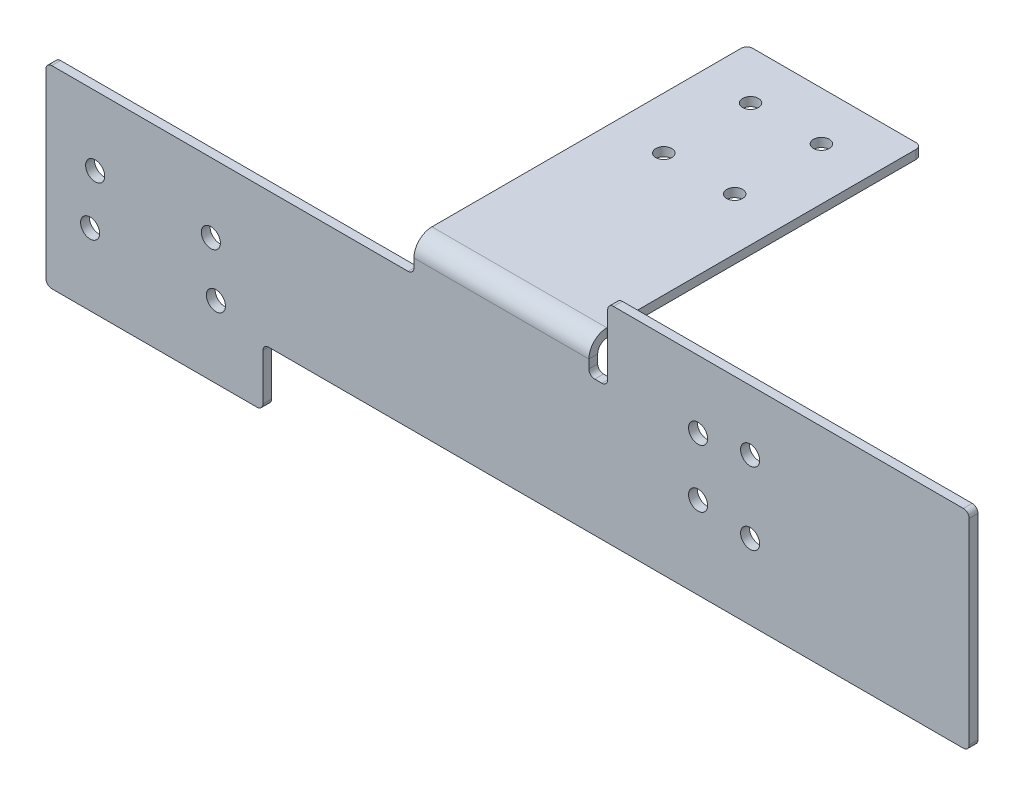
ISO-10303-21;
HEADER;
FILE_DESCRIPTION(('STEP AP214'),'2;1');
FILE_NAME('part.step','',(''),(''),'','','');
FILE_SCHEMA(('AUTOMOTIVE_DESIGN { 1 0 10303 214 1 1 1 1 }'));
ENDSEC;
DATA;
#1=APPLICATION_CONTEXT('core data for automotive mechanical design processes');
#2=APPLICATION_PROTOCOL_DEFINITION('international standard','automotive_design',2000,#1);
#3=PRODUCT_CONTEXT('',#1,'mechanical');
#4=PRODUCT('Part','Part','',(#3));
#5=PRODUCT_RELATED_PRODUCT_CATEGORY('part','',(#4));
#6=PRODUCT_DEFINITION_FORMATION('','',#4);
#7=PRODUCT_DEFINITION_CONTEXT('part definition',#1,'design');
#8=PRODUCT_DEFINITION('design','',#6,#7);
#9=PRODUCT_DEFINITION_SHAPE('','',#8);
#10=(LENGTH_UNIT() NAMED_UNIT(*) SI_UNIT(.MILLI.,.METRE.));
#11=(NAMED_UNIT(*) PLANE_ANGLE_UNIT() SI_UNIT($,.RADIAN.));
#12=(NAMED_UNIT(*) SI_UNIT($,.STERADIAN.) SOLID_ANGLE_UNIT());
#13=UNCERTAINTY_MEASURE_WITH_UNIT(LENGTH_MEASURE(1.E-05),#10,'distance_accuracy_value','');
#14=(GEOMETRIC_REPRESENTATION_CONTEXT(3) GLOBAL_UNCERTAINTY_ASSIGNED_CONTEXT((#13)) GLOBAL_UNIT_ASSIGNED_CONTEXT((#10,
#11,#12)) REPRESENTATION_CONTEXT('',''));
#15=CARTESIAN_POINT('',(0.,0.,0.));
#16=DIRECTION('',(0.,0.,1.));
#17=DIRECTION('',(1.,0.,0.));
#18=AXIS2_PLACEMENT_3D('',#15,#16,#17);
#19=CARTESIAN_POINT('',(182.,-8.17499999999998,6.22299999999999));
#20=DIRECTION('',(0.,-1.,0.));
#21=DIRECTION('',(0.,0.,-1.));
#22=AXIS2_PLACEMENT_3D('',#19,#20,#21);
#23=PLANE('',#22);
#24=DIRECTION('',(-1.,0.,0.));
#25=VECTOR('',#24,1.);
#26=CARTESIAN_POINT('',(182.,-8.17499999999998,6.22299999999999));
#27=LINE('',#26,#25);
#28=CARTESIAN_POINT('',(110.,-8.17499999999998,6.22299999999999));
#29=VERTEX_POINT('',#28);
#30=CARTESIAN_POINT('',(107.5,-8.17499999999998,6.22299999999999));
#31=VERTEX_POINT('',#30);
#32=EDGE_CURVE('E280',#29,#31,#27,.T.);
#33=ORIENTED_EDGE('',*,*,#32,.F.);
#34=DIRECTION('',(0.,0.,1.));
#35=VECTOR('',#34,1.);
#36=CARTESIAN_POINT('',(110.,-8.17499999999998,3.175));
#37=LINE('',#36,#35);
#38=CARTESIAN_POINT('',(110.,-8.17499999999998,3.175));
#39=VERTEX_POINT('',#38);
#40=EDGE_CURVE('E254',#29,#39,#37,.F.);
#41=ORIENTED_EDGE('',*,*,#40,.T.);
#42=DIRECTION('',(-1.,0.,0.));
#43=VECTOR('',#42,1.);
#44=CARTESIAN_POINT('',(182.,-8.17499999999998,3.175));
#45=LINE('',#44,#43);
#46=CARTESIAN_POINT('',(107.5,-8.17499999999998,3.175));
#47=VERTEX_POINT('',#46);
#48=EDGE_CURVE('E282',#39,#47,#45,.T.);
#49=ORIENTED_EDGE('',*,*,#48,.T.);
#50=DIRECTION('',(0.,0.,1.));
#51=VECTOR('',#50,1.);
#52=CARTESIAN_POINT('',(107.5,-8.17499999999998,6.22299999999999));
#53=LINE('',#52,#51);
#54=EDGE_CURVE('E398',#47,#31,#53,.T.);
#55=ORIENTED_EDGE('',*,*,#54,.T.);
#56=EDGE_LOOP('',(#33,#41,#49,#55));
#57=FACE_BOUND('',#56,.T.);
#58=ADVANCED_FACE('F59',(#57),#23,.F.);
#59=CARTESIAN_POINT('',(0.,0.,6.22299999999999));
#60=DIRECTION('',(0.,0.,1.));
#61=DIRECTION('',(0.,-1.,0.));
#62=AXIS2_PLACEMENT_3D('',#59,#60,#61);
#63=PLANE('',#62);
#64=CARTESIAN_POINT('',(143.25,-6.53499999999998,6.22299999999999));
#65=DIRECTION('',(0.,0.,1.));
#66=DIRECTION('',(1.,0.,0.));
#67=AXIS2_PLACEMENT_3D('',#64,#65,#66);
#68=CIRCLE('',#67,3.3);
#69=CARTESIAN_POINT('',(146.55,-6.53499999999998,6.22299999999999));
#70=VERTEX_POINT('',#69);
#71=EDGE_CURVE('E1088',#70,#70,#68,.T.);
#72=ORIENTED_EDGE('',*,*,#71,.F.);
#73=EDGE_LOOP('',(#72));
#74=FACE_BOUND('',#73,.T.);
#75=CARTESIAN_POINT('',(143.25,-26.535,6.22299999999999));
#76=DIRECTION('',(0.,0.,1.));
#77=DIRECTION('',(1.,0.,0.));
#78=AXIS2_PLACEMENT_3D('',#75,#76,#77);
#79=CIRCLE('',#78,3.3);
#80=CARTESIAN_POINT('',(146.55,-26.535,6.22299999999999));
#81=VERTEX_POINT('',#80);
#82=EDGE_CURVE('E1094',#81,#81,#79,.T.);
#83=ORIENTED_EDGE('',*,*,#82,.F.);
#84=EDGE_LOOP('',(#83));
#85=FACE_BOUND('',#84,.T.);
#86=CARTESIAN_POINT('',(161.25,-29.035,6.22299999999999));
#87=DIRECTION('',(0.,0.,1.));
#88=DIRECTION('',(1.,0.,0.));
#89=AXIS2_PLACEMENT_3D('',#86,#87,#88);
#90=CIRCLE('',#89,3.3);
#91=CARTESIAN_POINT('',(164.55,-29.035,6.22299999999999));
#92=VERTEX_POINT('',#91);
#93=EDGE_CURVE('E1100',#92,#92,#90,.T.);
#94=ORIENTED_EDGE('',*,*,#93,.F.);
#95=EDGE_LOOP('',(#94));
#96=FACE_BOUND('',#95,.T.);
#97=CARTESIAN_POINT('',(161.25,-4.03499999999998,6.22299999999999));
#98=DIRECTION('',(0.,0.,1.));
#99=DIRECTION('',(1.,0.,0.));
#100=AXIS2_PLACEMENT_3D('',#97,#98,#99);
#101=CIRCLE('',#100,3.3);
#102=CARTESIAN_POINT('',(164.55,-4.03499999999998,6.22299999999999));
#103=VERTEX_POINT('',#102);
#104=EDGE_CURVE('E1106',#103,#103,#101,.T.);
#105=ORIENTED_EDGE('',*,*,#104,.F.);
#106=EDGE_LOOP('',(#105));
#107=FACE_BOUND('',#106,.T.);
#108=CARTESIAN_POINT('',(-65.22,-32.175,6.22299999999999));
#109=DIRECTION('',(0.,0.,1.));
#110=DIRECTION('',(0.,-1.,0.));
#111=AXIS2_PLACEMENT_3D('',#108,#109,#110);
#112=CIRCLE('',#111,3.29999999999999);
#113=CARTESIAN_POINT('',(-65.22,-35.475,6.223));
#114=VERTEX_POINT('',#113);
#115=EDGE_CURVE('E303',#114,#114,#112,.T.);
#116=ORIENTED_EDGE('',*,*,#115,.F.);
#117=EDGE_LOOP('',(#116));
#118=FACE_BOUND('',#117,.T.);
#119=CARTESIAN_POINT('',(-66.97,-50.175,6.22299999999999));
#120=DIRECTION('',(0.,0.,1.));
#121=DIRECTION('',(0.,-1.,0.));
#122=AXIS2_PLACEMENT_3D('',#119,#120,#121);
#123=CIRCLE('',#122,3.29999999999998);
#124=CARTESIAN_POINT('',(-66.97,-53.475,6.223));
#125=VERTEX_POINT('',#124);
#126=EDGE_CURVE('E297',#125,#125,#123,.T.);
#127=ORIENTED_EDGE('',*,*,#126,.F.);
#128=EDGE_LOOP('',(#127));
#129=FACE_BOUND('',#128,.T.);
#130=CARTESIAN_POINT('',(-23.47,-50.175,6.22299999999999));
#131=DIRECTION('',(0.,0.,1.));
#132=DIRECTION('',(0.,-1.,0.));
#133=AXIS2_PLACEMENT_3D('',#130,#131,#132);
#134=CIRCLE('',#133,3.29999999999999);
#135=CARTESIAN_POINT('',(-23.47,-53.475,6.223));
#136=VERTEX_POINT('',#135);
#137=EDGE_CURVE('E291',#136,#136,#134,.T.);
#138=ORIENTED_EDGE('',*,*,#137,.F.);
#139=EDGE_LOOP('',(#138));
#140=FACE_BOUND('',#139,.T.);
#141=CARTESIAN_POINT('',(-25.22,-32.175,6.22299999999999));
#142=DIRECTION('',(0.,0.,1.));
#143=DIRECTION('',(0.,-1.,0.));
#144=AXIS2_PLACEMENT_3D('',#141,#142,#143);
#145=CIRCLE('',#144,3.29999999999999);
#146=CARTESIAN_POINT('',(-25.22,-35.475,6.223));
#147=VERTEX_POINT('',#146);
#148=EDGE_CURVE('E285',#147,#147,#145,.T.);
#149=ORIENTED_EDGE('',*,*,#148,.F.);
#150=EDGE_LOOP('',(#149));
#151=FACE_BOUND('',#150,.T.);
#152=DIRECTION('',(0.,-1.,0.));
#153=VECTOR('',#152,1.);
#154=CARTESIAN_POINT('',(237.,-75.,6.22299999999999));
#155=LINE('',#154,#153);
#156=CARTESIAN_POINT('',(237.,14.825,6.22299999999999));
#157=VERTEX_POINT('',#156);
#158=CARTESIAN_POINT('',(237.,-53.,6.22299999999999));
#159=VERTEX_POINT('',#158);
#160=EDGE_CURVE('E63',#157,#159,#155,.T.);
#161=ORIENTED_EDGE('',*,*,#160,.F.);
#162=CARTESIAN_POINT('',(235.,14.825,6.22299999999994));
#163=DIRECTION('',(0.,0.,1.));
#164=DIRECTION('',(0.,-1.,0.));
#165=AXIS2_PLACEMENT_3D('',#162,#163,#164);
#166=CIRCLE('',#165,2.);
#167=CARTESIAN_POINT('',(235.,16.825,6.22299999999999));
#168=VERTEX_POINT('',#167);
#169=EDGE_CURVE('E243',#157,#168,#166,.T.);
#170=ORIENTED_EDGE('',*,*,#169,.T.);
#171=DIRECTION('',(1.,0.,0.));
#172=VECTOR('',#171,1.);
#173=CARTESIAN_POINT('',(182.,16.825,6.22299999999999));
#174=LINE('',#173,#172);
#175=CARTESIAN_POINT('',(114.,16.825,6.22299999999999));
#176=VERTEX_POINT('',#175);
#177=EDGE_CURVE('E250',#176,#168,#174,.T.);
#178=ORIENTED_EDGE('',*,*,#177,.F.);
#179=CARTESIAN_POINT('',(114.,14.825,6.22299999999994));
#180=DIRECTION('',(0.,0.,1.));
#181=DIRECTION('',(0.,-1.,0.));
#182=AXIS2_PLACEMENT_3D('',#179,#180,#181);
#183=CIRCLE('',#182,2.);
#184=CARTESIAN_POINT('',(112.,14.825,6.22299999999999));
#185=VERTEX_POINT('',#184);
#186=EDGE_CURVE('E234',#176,#185,#183,.T.);
#187=ORIENTED_EDGE('',*,*,#186,.T.);
#188=DIRECTION('',(0.,-1.,0.));
#189=VECTOR('',#188,1.);
#190=CARTESIAN_POINT('',(112.,16.825,6.22299999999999));
#191=LINE('',#190,#189);
#192=CARTESIAN_POINT('',(112.,-6.17499999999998,6.22299999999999));
#193=VERTEX_POINT('',#192);
#194=EDGE_CURVE('E258',#185,#193,#191,.T.);
#195=ORIENTED_EDGE('',*,*,#194,.T.);
#196=CARTESIAN_POINT('',(110.,-6.17499999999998,6.22300000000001));
#197=DIRECTION('',(0.,0.,1.));
#198=DIRECTION('',(0.,-1.,0.));
#199=AXIS2_PLACEMENT_3D('',#196,#197,#198);
#200=CIRCLE('',#199,2.);
#201=EDGE_CURVE('E68',#193,#29,#200,.F.);
#202=ORIENTED_EDGE('',*,*,#201,.T.);
#203=ORIENTED_EDGE('',*,*,#32,.T.);
#204=CARTESIAN_POINT('',(107.5,-6.17499999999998,6.22300000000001));
#205=DIRECTION('',(0.,0.,1.));
#206=DIRECTION('',(0.,-1.,0.));
#207=AXIS2_PLACEMENT_3D('',#204,#205,#206);
#208=CIRCLE('',#207,2.);
#209=CARTESIAN_POINT('',(105.5,-6.17499999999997,6.22300000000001));
#210=VERTEX_POINT('',#209);
#211=EDGE_CURVE('E416',#31,#210,#208,.F.);
#212=ORIENTED_EDGE('',*,*,#211,.T.);
#213=DIRECTION('',(0.,-1.,0.));
#214=VECTOR('',#213,1.);
#215=CARTESIAN_POINT('',(105.5,-75.,6.22300000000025));
#216=LINE('',#215,#214);
#217=CARTESIAN_POINT('',(105.5,-3.17499999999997,6.223));
#218=VERTEX_POINT('',#217);
#219=EDGE_CURVE('E337',#218,#210,#216,.T.);
#220=ORIENTED_EDGE('',*,*,#219,.F.);
#221=DIRECTION('',(-1.,0.,0.));
#222=VECTOR('',#221,1.);
#223=CARTESIAN_POINT('',(0.,-3.17499999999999,6.223));
#224=LINE('',#223,#222);
#225=CARTESIAN_POINT('',(45.,-3.17499999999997,6.223));
#226=VERTEX_POINT('',#225);
#227=EDGE_CURVE('E343',#218,#226,#224,.T.);
#228=ORIENTED_EDGE('',*,*,#227,.T.);
#229=DIRECTION('',(0.,1.,0.));
#230=VECTOR('',#229,1.);
#231=CARTESIAN_POINT('',(45.,0.,6.22299999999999));
#232=LINE('',#231,#230);
#233=CARTESIAN_POINT('',(45.,-6.17499999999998,6.22300000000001));
#234=VERTEX_POINT('',#233);
#235=EDGE_CURVE('E336',#234,#226,#232,.T.);
#236=ORIENTED_EDGE('',*,*,#235,.F.);
#237=CARTESIAN_POINT('',(43.,-6.17499999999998,6.22300000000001));
#238=DIRECTION('',(0.,0.,1.));
#239=DIRECTION('',(0.,-1.,0.));
#240=AXIS2_PLACEMENT_3D('',#237,#238,#239);
#241=CIRCLE('',#240,2.);
#242=CARTESIAN_POINT('',(43.,-8.17499999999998,6.223));
#243=VERTEX_POINT('',#242);
#244=EDGE_CURVE('E471',#234,#243,#241,.F.);
#245=ORIENTED_EDGE('',*,*,#244,.T.);
#246=DIRECTION('',(1.,0.,0.));
#247=VECTOR('',#246,1.);
#248=CARTESIAN_POINT('',(-82.22,-8.17499999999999,6.223));
#249=LINE('',#248,#247);
#250=CARTESIAN_POINT('',(-80.22,-8.17499999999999,6.223));
#251=VERTEX_POINT('',#250);
#252=EDGE_CURVE('E330',#251,#243,#249,.T.);
#253=ORIENTED_EDGE('',*,*,#252,.F.);
#254=CARTESIAN_POINT('',(-80.22,-10.175,6.22300000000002));
#255=DIRECTION('',(0.,0.,1.));
#256=DIRECTION('',(0.,-1.,0.));
#257=AXIS2_PLACEMENT_3D('',#254,#255,#256);
#258=CIRCLE('',#257,2.);
#259=CARTESIAN_POINT('',(-82.22,-10.175,6.22300000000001));
#260=VERTEX_POINT('',#259);
#261=EDGE_CURVE('E383',#251,#260,#258,.T.);
#262=ORIENTED_EDGE('',*,*,#261,.T.);
#263=DIRECTION('',(0.,1.,0.));
#264=VECTOR('',#263,1.);
#265=CARTESIAN_POINT('',(-82.22,-75.,6.22300000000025));
#266=LINE('',#265,#264);
#267=CARTESIAN_POINT('',(-82.22,-73.,6.22300000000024));
#268=VERTEX_POINT('',#267);
#269=EDGE_CURVE('E321',#268,#260,#266,.T.);
#270=ORIENTED_EDGE('',*,*,#269,.F.);
#271=CARTESIAN_POINT('',(-80.22,-73.,6.22300000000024));
#272=DIRECTION('',(0.,0.,1.));
#273=DIRECTION('',(0.,-1.,0.));
#274=AXIS2_PLACEMENT_3D('',#271,#272,#273);
#275=CIRCLE('',#274,2.);
#276=CARTESIAN_POINT('',(-80.22,-75.,6.22300000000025));
#277=VERTEX_POINT('',#276);
#278=EDGE_CURVE('E119',#268,#277,#275,.T.);
#279=ORIENTED_EDGE('',*,*,#278,.T.);
#280=DIRECTION('',(-1.,0.,0.));
#281=VECTOR('',#280,1.);
#282=CARTESIAN_POINT('',(0.,-75.,6.22300000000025));
#283=LINE('',#282,#281);
#284=CARTESIAN_POINT('',(-9.22,-75.,6.22300000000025));
#285=VERTEX_POINT('',#284);
#286=EDGE_CURVE('E334',#285,#277,#283,.T.);
#287=ORIENTED_EDGE('',*,*,#286,.F.);
#288=CARTESIAN_POINT('',(-9.22,-73.,6.22300000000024));
#289=DIRECTION('',(0.,0.,1.));
#290=DIRECTION('',(0.,-1.,0.));
#291=AXIS2_PLACEMENT_3D('',#288,#289,#290);
#292=CIRCLE('',#291,2.);
#293=CARTESIAN_POINT('',(-7.22,-73.,6.22300000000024));
#294=VERTEX_POINT('',#293);
#295=EDGE_CURVE('E387',#285,#294,#292,.T.);
#296=ORIENTED_EDGE('',*,*,#295,.T.);
#297=DIRECTION('',(0.,-1.,0.));
#298=VECTOR('',#297,1.);
#299=CARTESIAN_POINT('',(-7.22,0.,6.22299999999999));
#300=LINE('',#299,#298);
#301=CARTESIAN_POINT('',(-7.22,-57.,6.22300000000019));
#302=VERTEX_POINT('',#301);
#303=EDGE_CURVE('E269',#302,#294,#300,.T.);
#304=ORIENTED_EDGE('',*,*,#303,.F.);
#305=CARTESIAN_POINT('',(-5.22,-57.,6.22300000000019));
#306=DIRECTION('',(0.,0.,1.));
#307=DIRECTION('',(0.,-1.,0.));
#308=AXIS2_PLACEMENT_3D('',#305,#306,#307);
#309=CIRCLE('',#308,2.);
#310=CARTESIAN_POINT('',(-5.22,-55.,6.22300000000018));
#311=VERTEX_POINT('',#310);
#312=EDGE_CURVE('E410',#302,#311,#309,.F.);
#313=ORIENTED_EDGE('',*,*,#312,.T.);
#314=DIRECTION('',(1.,0.,0.));
#315=VECTOR('',#314,1.);
#316=CARTESIAN_POINT('',(0.,-55.,6.22300000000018));
#317=LINE('',#316,#315);
#318=CARTESIAN_POINT('',(235.,-55.,6.22300000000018));
#319=VERTEX_POINT('',#318);
#320=EDGE_CURVE('E272',#319,#311,#317,.F.);
#321=ORIENTED_EDGE('',*,*,#320,.F.);
#322=CARTESIAN_POINT('',(235.,-53.,6.22300000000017));
#323=DIRECTION('',(0.,0.,1.));
#324=DIRECTION('',(0.,-1.,0.));
#325=AXIS2_PLACEMENT_3D('',#322,#323,#324);
#326=CIRCLE('',#325,2.);
#327=EDGE_CURVE('E386',#319,#159,#326,.T.);
#328=ORIENTED_EDGE('',*,*,#327,.T.);
#329=EDGE_LOOP('',(#161,#170,#178,#187,#195,#202,#203,#212,#220,#228,#236,#245,#253,#262,#270,
#279,#287,#296,#304,#313,#321,#328));
#330=FACE_BOUND('',#329,.T.);
#331=ADVANCED_FACE('F256',(#74,#85,#96,#107,#118,#129,#140,#151,#330),#63,.T.);
#332=CARTESIAN_POINT('',(0.,0.,3.17499999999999));
#333=DIRECTION('',(0.,0.,1.));
#334=DIRECTION('',(0.,-1.,0.));
#335=AXIS2_PLACEMENT_3D('',#332,#333,#334);
#336=PLANE('',#335);
#337=CARTESIAN_POINT('',(143.25,-6.53499999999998,3.17500000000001));
#338=DIRECTION('',(0.,0.,1.));
#339=DIRECTION('',(0.,-1.,0.));
#340=AXIS2_PLACEMENT_3D('',#337,#338,#339);
#341=CIRCLE('',#340,3.29999999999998);
#342=CARTESIAN_POINT('',(143.25,-9.83499999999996,3.17500000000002));
#343=VERTEX_POINT('',#342);
#344=EDGE_CURVE('E1091',#343,#343,#341,.T.);
#345=ORIENTED_EDGE('',*,*,#344,.T.);
#346=EDGE_LOOP('',(#345));
#347=FACE_BOUND('',#346,.T.);
#348=CARTESIAN_POINT('',(143.25,-26.535,3.17500000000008));
#349=DIRECTION('',(0.,0.,1.));
#350=DIRECTION('',(0.,-1.,0.));
#351=AXIS2_PLACEMENT_3D('',#348,#349,#350);
#352=CIRCLE('',#351,3.29999999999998);
#353=CARTESIAN_POINT('',(143.25,-29.835,3.17500000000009));
#354=VERTEX_POINT('',#353);
#355=EDGE_CURVE('E1097',#354,#354,#352,.T.);
#356=ORIENTED_EDGE('',*,*,#355,.T.);
#357=EDGE_LOOP('',(#356));
#358=FACE_BOUND('',#357,.T.);
#359=CARTESIAN_POINT('',(161.25,-29.035,3.17500000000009));
#360=DIRECTION('',(0.,0.,1.));
#361=DIRECTION('',(0.,-1.,0.));
#362=AXIS2_PLACEMENT_3D('',#359,#360,#361);
#363=CIRCLE('',#362,3.29999999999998);
#364=CARTESIAN_POINT('',(161.25,-32.335,3.1750000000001));
#365=VERTEX_POINT('',#364);
#366=EDGE_CURVE('E1103',#365,#365,#363,.T.);
#367=ORIENTED_EDGE('',*,*,#366,.T.);
#368=EDGE_LOOP('',(#367));
#369=FACE_BOUND('',#368,.T.);
#370=CARTESIAN_POINT('',(161.25,-4.03499999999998,3.175));
#371=DIRECTION('',(0.,0.,1.));
#372=DIRECTION('',(0.,-1.,0.));
#373=AXIS2_PLACEMENT_3D('',#370,#371,#372);
#374=CIRCLE('',#373,3.29999999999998);
#375=CARTESIAN_POINT('',(161.25,-7.33499999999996,3.17500000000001));
#376=VERTEX_POINT('',#375);
#377=EDGE_CURVE('E262',#376,#376,#374,.T.);
#378=ORIENTED_EDGE('',*,*,#377,.T.);
#379=EDGE_LOOP('',(#378));
#380=FACE_BOUND('',#379,.T.);
#381=CARTESIAN_POINT('',(-65.22,-32.175,3.1750000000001));
#382=DIRECTION('',(0.,0.,1.));
#383=DIRECTION('',(0.,-1.,0.));
#384=AXIS2_PLACEMENT_3D('',#381,#382,#383);
#385=CIRCLE('',#384,3.29999999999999);
#386=CARTESIAN_POINT('',(-65.22,-35.475,3.17500000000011));
#387=VERTEX_POINT('',#386);
#388=EDGE_CURVE('E306',#387,#387,#385,.T.);
#389=ORIENTED_EDGE('',*,*,#388,.T.);
#390=EDGE_LOOP('',(#389));
#391=FACE_BOUND('',#390,.T.);
#392=CARTESIAN_POINT('',(-66.97,-50.175,3.17500000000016));
#393=DIRECTION('',(0.,0.,1.));
#394=DIRECTION('',(0.,-1.,0.));
#395=AXIS2_PLACEMENT_3D('',#392,#393,#394);
#396=CIRCLE('',#395,3.29999999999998);
#397=CARTESIAN_POINT('',(-66.97,-53.475,3.17500000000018));
#398=VERTEX_POINT('',#397);
#399=EDGE_CURVE('E300',#398,#398,#396,.T.);
#400=ORIENTED_EDGE('',*,*,#399,.T.);
#401=EDGE_LOOP('',(#400));
#402=FACE_BOUND('',#401,.T.);
#403=CARTESIAN_POINT('',(-23.47,-50.175,3.17500000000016));
#404=DIRECTION('',(0.,0.,1.));
#405=DIRECTION('',(0.,-1.,0.));
#406=AXIS2_PLACEMENT_3D('',#403,#404,#405);
#407=CIRCLE('',#406,3.29999999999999);
#408=CARTESIAN_POINT('',(-23.47,-53.475,3.17500000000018));
#409=VERTEX_POINT('',#408);
#410=EDGE_CURVE('E294',#409,#409,#407,.T.);
#411=ORIENTED_EDGE('',*,*,#410,.T.);
#412=EDGE_LOOP('',(#411));
#413=FACE_BOUND('',#412,.T.);
#414=CARTESIAN_POINT('',(-25.22,-32.175,3.1750000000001));
#415=DIRECTION('',(0.,0.,1.));
#416=DIRECTION('',(0.,-1.,0.));
#417=AXIS2_PLACEMENT_3D('',#414,#415,#416);
#418=CIRCLE('',#417,3.29999999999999);
#419=CARTESIAN_POINT('',(-25.22,-35.475,3.17500000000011));
#420=VERTEX_POINT('',#419);
#421=EDGE_CURVE('E288',#420,#420,#418,.T.);
#422=ORIENTED_EDGE('',*,*,#421,.T.);
#423=EDGE_LOOP('',(#422));
#424=FACE_BOUND('',#423,.T.);
#425=DIRECTION('',(-1.,0.,0.));
#426=VECTOR('',#425,1.);
#427=CARTESIAN_POINT('',(182.,16.825,3.175));
#428=LINE('',#427,#426);
#429=CARTESIAN_POINT('',(235.,16.825,3.175));
#430=VERTEX_POINT('',#429);
#431=CARTESIAN_POINT('',(114.,16.825,3.175));
#432=VERTEX_POINT('',#431);
#433=EDGE_CURVE('E252',#430,#432,#428,.T.);
#434=ORIENTED_EDGE('',*,*,#433,.F.);
#435=CARTESIAN_POINT('',(235.,14.825,3.17499999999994));
#436=DIRECTION('',(0.,0.,1.));
#437=DIRECTION('',(0.,-1.,0.));
#438=AXIS2_PLACEMENT_3D('',#435,#436,#437);
#439=CIRCLE('',#438,2.);
#440=CARTESIAN_POINT('',(237.,14.825,3.175));
#441=VERTEX_POINT('',#440);
#442=EDGE_CURVE('E85',#430,#441,#439,.F.);
#443=ORIENTED_EDGE('',*,*,#442,.T.);
#444=DIRECTION('',(0.,1.,0.));
#445=VECTOR('',#444,1.);
#446=CARTESIAN_POINT('',(237.,-75.,3.175));
#447=LINE('',#446,#445);
#448=CARTESIAN_POINT('',(237.,-53.,3.175));
#449=VERTEX_POINT('',#448);
#450=EDGE_CURVE('E283',#449,#441,#447,.T.);
#451=ORIENTED_EDGE('',*,*,#450,.F.);
#452=CARTESIAN_POINT('',(235.,-53.,3.17500000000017));
#453=DIRECTION('',(0.,0.,1.));
#454=DIRECTION('',(0.,-1.,0.));
#455=AXIS2_PLACEMENT_3D('',#452,#453,#454);
#456=CIRCLE('',#455,2.);
#457=CARTESIAN_POINT('',(235.,-55.,3.17500000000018));
#458=VERTEX_POINT('',#457);
#459=EDGE_CURVE('E394',#449,#458,#456,.F.);
#460=ORIENTED_EDGE('',*,*,#459,.T.);
#461=DIRECTION('',(-1.,0.,0.));
#462=VECTOR('',#461,1.);
#463=CARTESIAN_POINT('',(0.,-55.,3.17500000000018));
#464=LINE('',#463,#462);
#465=CARTESIAN_POINT('',(-5.22,-55.,3.17500000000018));
#466=VERTEX_POINT('',#465);
#467=EDGE_CURVE('E273',#458,#466,#464,.T.);
#468=ORIENTED_EDGE('',*,*,#467,.T.);
#469=CARTESIAN_POINT('',(-5.22,-57.,3.17500000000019));
#470=DIRECTION('',(0.,0.,1.));
#471=DIRECTION('',(0.,-1.,0.));
#472=AXIS2_PLACEMENT_3D('',#469,#470,#471);
#473=CIRCLE('',#472,2.);
#474=CARTESIAN_POINT('',(-7.22,-57.,3.17500000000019));
#475=VERTEX_POINT('',#474);
#476=EDGE_CURVE('E413',#466,#475,#473,.T.);
#477=ORIENTED_EDGE('',*,*,#476,.T.);
#478=DIRECTION('',(0.,-1.,0.));
#479=VECTOR('',#478,1.);
#480=CARTESIAN_POINT('',(-7.22,0.,3.17499999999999));
#481=LINE('',#480,#479);
#482=CARTESIAN_POINT('',(-7.22,-73.,3.17500000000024));
#483=VERTEX_POINT('',#482);
#484=EDGE_CURVE('E268',#475,#483,#481,.T.);
#485=ORIENTED_EDGE('',*,*,#484,.T.);
#486=CARTESIAN_POINT('',(-9.22,-73.,3.17500000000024));
#487=DIRECTION('',(0.,0.,1.));
#488=DIRECTION('',(0.,-1.,0.));
#489=AXIS2_PLACEMENT_3D('',#486,#487,#488);
#490=CIRCLE('',#489,2.);
#491=CARTESIAN_POINT('',(-9.22,-75.,3.17500000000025));
#492=VERTEX_POINT('',#491);
#493=EDGE_CURVE('E395',#483,#492,#490,.F.);
#494=ORIENTED_EDGE('',*,*,#493,.T.);
#495=DIRECTION('',(1.,0.,0.));
#496=VECTOR('',#495,1.);
#497=CARTESIAN_POINT('',(0.,-75.,3.17500000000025));
#498=LINE('',#497,#496);
#499=CARTESIAN_POINT('',(-80.22,-75.,3.17500000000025));
#500=VERTEX_POINT('',#499);
#501=EDGE_CURVE('E338',#492,#500,#498,.F.);
#502=ORIENTED_EDGE('',*,*,#501,.T.);
#503=CARTESIAN_POINT('',(-80.22,-73.,3.17500000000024));
#504=DIRECTION('',(0.,0.,1.));
#505=DIRECTION('',(0.,-1.,0.));
#506=AXIS2_PLACEMENT_3D('',#503,#504,#505);
#507=CIRCLE('',#506,2.);
#508=CARTESIAN_POINT('',(-82.22,-73.,3.17500000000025));
#509=VERTEX_POINT('',#508);
#510=EDGE_CURVE('E392',#500,#509,#507,.F.);
#511=ORIENTED_EDGE('',*,*,#510,.T.);
#512=DIRECTION('',(0.,-1.,0.));
#513=VECTOR('',#512,1.);
#514=CARTESIAN_POINT('',(-82.22,-75.,3.17500000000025));
#515=LINE('',#514,#513);
#516=CARTESIAN_POINT('',(-82.22,-10.175,3.17500000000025));
#517=VERTEX_POINT('',#516);
#518=EDGE_CURVE('E324',#517,#509,#515,.T.);
#519=ORIENTED_EDGE('',*,*,#518,.F.);
#520=CARTESIAN_POINT('',(-80.22,-10.175,3.17500000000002));
#521=DIRECTION('',(0.,0.,1.));
#522=DIRECTION('',(0.,-1.,0.));
#523=AXIS2_PLACEMENT_3D('',#520,#521,#522);
#524=CIRCLE('',#523,2.);
#525=CARTESIAN_POINT('',(-80.22,-8.17499999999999,3.17500000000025));
#526=VERTEX_POINT('',#525);
#527=EDGE_CURVE('E390',#517,#526,#524,.F.);
#528=ORIENTED_EDGE('',*,*,#527,.T.);
#529=DIRECTION('',(1.,0.,0.));
#530=VECTOR('',#529,1.);
#531=CARTESIAN_POINT('',(-82.22,-8.17499999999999,3.17500000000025));
#532=LINE('',#531,#530);
#533=CARTESIAN_POINT('',(43.,-8.17499999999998,3.17500000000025));
#534=VERTEX_POINT('',#533);
#535=EDGE_CURVE('E327',#526,#534,#532,.T.);
#536=ORIENTED_EDGE('',*,*,#535,.T.);
#537=CARTESIAN_POINT('',(43.,-6.17499999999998,3.17500000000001));
#538=DIRECTION('',(0.,0.,1.));
#539=DIRECTION('',(0.,-1.,0.));
#540=AXIS2_PLACEMENT_3D('',#537,#538,#539);
#541=CIRCLE('',#540,2.);
#542=CARTESIAN_POINT('',(45.,-6.17499999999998,3.17500000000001));
#543=VERTEX_POINT('',#542);
#544=EDGE_CURVE('E448',#534,#543,#541,.T.);
#545=ORIENTED_EDGE('',*,*,#544,.T.);
#546=DIRECTION('',(0.,-1.,0.));
#547=VECTOR('',#546,1.);
#548=CARTESIAN_POINT('',(45.,0.,3.17499999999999));
#549=LINE('',#548,#547);
#550=CARTESIAN_POINT('',(45.,-3.17499999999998,3.175));
#551=VERTEX_POINT('',#550);
#552=EDGE_CURVE('E341',#543,#551,#549,.F.);
#553=ORIENTED_EDGE('',*,*,#552,.T.);
#554=DIRECTION('',(1.,0.,0.));
#555=VECTOR('',#554,1.);
#556=CARTESIAN_POINT('',(80.,-3.17499999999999,3.175));
#557=LINE('',#556,#555);
#558=CARTESIAN_POINT('',(105.5,-3.17499999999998,3.175));
#559=VERTEX_POINT('',#558);
#560=EDGE_CURVE('E347',#559,#551,#557,.F.);
#561=ORIENTED_EDGE('',*,*,#560,.F.);
#562=DIRECTION('',(0.,1.,0.));
#563=VECTOR('',#562,1.);
#564=CARTESIAN_POINT('',(105.5,0.,3.17499999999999));
#565=LINE('',#564,#563);
#566=CARTESIAN_POINT('',(105.5,-6.17499999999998,3.17500000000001));
#567=VERTEX_POINT('',#566);
#568=EDGE_CURVE('E342',#559,#567,#565,.F.);
#569=ORIENTED_EDGE('',*,*,#568,.T.);
#570=CARTESIAN_POINT('',(107.5,-6.17499999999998,3.17500000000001));
#571=DIRECTION('',(0.,0.,1.));
#572=DIRECTION('',(0.,-1.,0.));
#573=AXIS2_PLACEMENT_3D('',#570,#571,#572);
#574=CIRCLE('',#573,2.);
#575=EDGE_CURVE('E445',#567,#47,#574,.T.);
#576=ORIENTED_EDGE('',*,*,#575,.T.);
#577=ORIENTED_EDGE('',*,*,#48,.F.);
#578=CARTESIAN_POINT('',(110.,-6.17499999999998,3.17500000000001));
#579=DIRECTION('',(0.,0.,1.));
#580=DIRECTION('',(0.,-1.,0.));
#581=AXIS2_PLACEMENT_3D('',#578,#579,#580);
#582=CIRCLE('',#581,2.);
#583=CARTESIAN_POINT('',(112.,-6.17499999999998,3.175));
#584=VERTEX_POINT('',#583);
#585=EDGE_CURVE('E14',#39,#584,#582,.T.);
#586=ORIENTED_EDGE('',*,*,#585,.T.);
#587=DIRECTION('',(0.,-1.,0.));
#588=VECTOR('',#587,1.);
#589=CARTESIAN_POINT('',(112.,16.825,3.175));
#590=LINE('',#589,#588);
#591=CARTESIAN_POINT('',(112.,14.825,3.175));
#592=VERTEX_POINT('',#591);
#593=EDGE_CURVE('E260',#592,#584,#590,.T.);
#594=ORIENTED_EDGE('',*,*,#593,.F.);
#595=CARTESIAN_POINT('',(114.,14.825,3.17499999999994));
#596=DIRECTION('',(0.,0.,1.));
#597=DIRECTION('',(0.,-1.,0.));
#598=AXIS2_PLACEMENT_3D('',#595,#596,#597);
#599=CIRCLE('',#598,2.);
#600=EDGE_CURVE('E487',#592,#432,#599,.F.);
#601=ORIENTED_EDGE('',*,*,#600,.T.);
#602=EDGE_LOOP('',(#434,#443,#451,#460,#468,#477,#485,#494,#502,#511,#519,#528,#536,#545,#553,
#561,#569,#576,#577,#586,#594,#601));
#603=FACE_BOUND('',#602,.T.);
#604=ADVANCED_FACE('F504',(#347,#358,#369,#380,#391,#402,#413,#424,#603),#336,.F.);
#605=CARTESIAN_POINT('',(0.,-75.,6.22300000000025));
#606=DIRECTION('',(0.,-1.,0.));
#607=DIRECTION('',(0.,0.,-1.));
#608=AXIS2_PLACEMENT_3D('',#605,#606,#607);
#609=PLANE('',#608);
#610=ORIENTED_EDGE('',*,*,#501,.F.);
#611=DIRECTION('',(0.,0.,-1.));
#612=VECTOR('',#611,1.);
#613=CARTESIAN_POINT('',(-9.22,-75.,6.22300000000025));
#614=LINE('',#613,#612);
#615=EDGE_CURVE('E380',#492,#285,#614,.F.);
#616=ORIENTED_EDGE('',*,*,#615,.T.);
#617=ORIENTED_EDGE('',*,*,#286,.T.);
#618=DIRECTION('',(0.,0.,1.));
#619=VECTOR('',#618,1.);
#620=CARTESIAN_POINT('',(-80.22,-75.,6.22300000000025));
#621=LINE('',#620,#619);
#622=EDGE_CURVE('E377',#277,#500,#621,.F.);
#623=ORIENTED_EDGE('',*,*,#622,.T.);
#624=EDGE_LOOP('',(#610,#616,#617,#623));
#625=FACE_BOUND('',#624,.T.);
#626=ADVANCED_FACE('F524',(#625),#609,.T.);
#627=CARTESIAN_POINT('',(237.,0.,0.));
#628=DIRECTION('',(-1.,0.,0.));
#629=DIRECTION('',(0.,0.,1.));
#630=AXIS2_PLACEMENT_3D('',#627,#628,#629);
#631=PLANE('',#630);
#632=ORIENTED_EDGE('',*,*,#450,.T.);
#633=DIRECTION('',(0.,0.,-1.));
#634=VECTOR('',#633,1.);
#635=CARTESIAN_POINT('',(237.,14.825,6.22299999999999));
#636=LINE('',#635,#634);
#637=EDGE_CURVE('E76',#441,#157,#636,.F.);
#638=ORIENTED_EDGE('',*,*,#637,.T.);
#639=ORIENTED_EDGE('',*,*,#160,.T.);
#640=DIRECTION('',(0.,0.,-1.));
#641=VECTOR('',#640,1.);
#642=CARTESIAN_POINT('',(237.,-53.,3.17499999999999));
#643=LINE('',#642,#641);
#644=EDGE_CURVE('E402',#159,#449,#643,.T.);
#645=ORIENTED_EDGE('',*,*,#644,.T.);
#646=EDGE_LOOP('',(#632,#638,#639,#645));
#647=FACE_BOUND('',#646,.T.);
#648=ADVANCED_FACE('F61',(#647),#631,.F.);
#649=CARTESIAN_POINT('',(105.5,-75.,6.22300000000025));
#650=DIRECTION('',(1.,0.,0.));
#651=DIRECTION('',(0.,0.,-1.));
#652=AXIS2_PLACEMENT_3D('',#649,#650,#651);
#653=PLANE('',#652);
#654=ORIENTED_EDGE('',*,*,#219,.T.);
#655=DIRECTION('',(0.,0.,1.));
#656=VECTOR('',#655,1.);
#657=CARTESIAN_POINT('',(105.5,-6.17499999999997,6.22300000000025));
#658=LINE('',#657,#656);
#659=EDGE_CURVE('E426',#210,#567,#658,.F.);
#660=ORIENTED_EDGE('',*,*,#659,.T.);
#661=ORIENTED_EDGE('',*,*,#568,.F.);
#662=DIRECTION('',(0.,0.,1.));
#663=VECTOR('',#662,1.);
#664=CARTESIAN_POINT('',(105.5,-3.17499999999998,6.22300000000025));
#665=LINE('',#664,#663);
#666=EDGE_CURVE('E333',#559,#218,#665,.T.);
#667=ORIENTED_EDGE('',*,*,#666,.T.);
#668=EDGE_LOOP('',(#654,#660,#661,#667));
#669=FACE_BOUND('',#668,.T.);
#670=ADVANCED_FACE('F569',(#669),#653,.T.);
#671=CARTESIAN_POINT('',(45.,0.,6.22299999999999));
#672=DIRECTION('',(-1.,0.,0.));
#673=DIRECTION('',(0.,0.,1.));
#674=AXIS2_PLACEMENT_3D('',#671,#672,#673);
#675=PLANE('',#674);
#676=ORIENTED_EDGE('',*,*,#552,.F.);
#677=DIRECTION('',(0.,0.,-1.));
#678=VECTOR('',#677,1.);
#679=CARTESIAN_POINT('',(45.,-6.17499999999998,6.22299999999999));
#680=LINE('',#679,#678);
#681=EDGE_CURVE('E407',#543,#234,#680,.F.);
#682=ORIENTED_EDGE('',*,*,#681,.T.);
#683=ORIENTED_EDGE('',*,*,#235,.T.);
#684=DIRECTION('',(0.,0.,1.));
#685=VECTOR('',#684,1.);
#686=CARTESIAN_POINT('',(45.,-3.17499999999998,3.175));
#687=LINE('',#686,#685);
#688=EDGE_CURVE('E346',#551,#226,#687,.T.);
#689=ORIENTED_EDGE('',*,*,#688,.F.);
#690=EDGE_LOOP('',(#676,#682,#683,#689));
#691=FACE_BOUND('',#690,.T.);
#692=ADVANCED_FACE('F552',(#691),#675,.T.);
#693=CARTESIAN_POINT('',(45.,3.04800000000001,0.));
#694=DIRECTION('',(1.,0.,0.));
#695=DIRECTION('',(0.,0.,-1.));
#696=AXIS2_PLACEMENT_3D('',#693,#694,#695);
#697=PLANE('',#696);
#698=DIRECTION('',(0.,0.,1.));
#699=VECTOR('',#698,1.);
#700=CARTESIAN_POINT('',(45.,3.04800000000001,0.));
#701=LINE('',#700,#699);
#702=CARTESIAN_POINT('',(45.,3.04800000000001,-106.92));
#703=VERTEX_POINT('',#702);
#704=CARTESIAN_POINT('',(45.,3.04800000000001,0.));
#705=VERTEX_POINT('',#704);
#706=EDGE_CURVE('E354',#703,#705,#701,.T.);
#707=ORIENTED_EDGE('',*,*,#706,.F.);
#708=DIRECTION('',(0.,-1.,0.));
#709=VECTOR('',#708,1.);
#710=CARTESIAN_POINT('',(45.,3.04800000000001,-106.92));
#711=LINE('',#710,#709);
#712=CARTESIAN_POINT('',(45.,0.,-106.92));
#713=VERTEX_POINT('',#712);
#714=EDGE_CURVE('E370',#703,#713,#711,.T.);
#715=ORIENTED_EDGE('',*,*,#714,.T.);
#716=DIRECTION('',(0.,0.,1.));
#717=VECTOR('',#716,1.);
#718=CARTESIAN_POINT('',(45.,0.,0.));
#719=LINE('',#718,#717);
#720=CARTESIAN_POINT('',(45.,0.,0.));
#721=VERTEX_POINT('',#720);
#722=EDGE_CURVE('E362',#713,#721,#719,.T.);
#723=ORIENTED_EDGE('',*,*,#722,.T.);
#724=DIRECTION('',(0.,-1.,0.));
#725=VECTOR('',#724,1.);
#726=CARTESIAN_POINT('',(45.,3.04800000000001,0.));
#727=LINE('',#726,#725);
#728=EDGE_CURVE('E423',#705,#721,#727,.T.);
#729=ORIENTED_EDGE('',*,*,#728,.F.);
#730=EDGE_LOOP('',(#707,#715,#723,#729));
#731=FACE_BOUND('',#730,.T.);
#732=ADVANCED_FACE('F685',(#731),#697,.F.);
#733=CARTESIAN_POINT('',(105.5,3.048,0.));
#734=DIRECTION('',(-1.,0.,0.));
#735=DIRECTION('',(0.,0.,1.));
#736=AXIS2_PLACEMENT_3D('',#733,#734,#735);
#737=PLANE('',#736);
#738=DIRECTION('',(0.,0.,-1.));
#739=VECTOR('',#738,1.);
#740=CARTESIAN_POINT('',(105.5,0.,0.));
#741=LINE('',#740,#739);
#742=CARTESIAN_POINT('',(105.5,0.,0.));
#743=VERTEX_POINT('',#742);
#744=CARTESIAN_POINT('',(105.5,0.,-106.92));
#745=VERTEX_POINT('',#744);
#746=EDGE_CURVE('E361',#743,#745,#741,.T.);
#747=ORIENTED_EDGE('',*,*,#746,.T.);
#748=DIRECTION('',(0.,-1.,0.));
#749=VECTOR('',#748,1.);
#750=CARTESIAN_POINT('',(105.5,3.048,-106.92));
#751=LINE('',#750,#749);
#752=CARTESIAN_POINT('',(105.5,3.048,-106.92));
#753=VERTEX_POINT('',#752);
#754=EDGE_CURVE('E417',#745,#753,#751,.F.);
#755=ORIENTED_EDGE('',*,*,#754,.T.);
#756=DIRECTION('',(0.,0.,-1.));
#757=VECTOR('',#756,1.);
#758=CARTESIAN_POINT('',(105.5,3.048,0.));
#759=LINE('',#758,#757);
#760=CARTESIAN_POINT('',(105.5,3.048,0.));
#761=VERTEX_POINT('',#760);
#762=EDGE_CURVE('E353',#761,#753,#759,.T.);
#763=ORIENTED_EDGE('',*,*,#762,.F.);
#764=DIRECTION('',(0.,-1.,0.));
#765=VECTOR('',#764,1.);
#766=CARTESIAN_POINT('',(105.5,3.048,0.));
#767=LINE('',#766,#765);
#768=EDGE_CURVE('E358',#761,#743,#767,.T.);
#769=ORIENTED_EDGE('',*,*,#768,.T.);
#770=EDGE_LOOP('',(#747,#755,#763,#769));
#771=FACE_BOUND('',#770,.T.);
#772=ADVANCED_FACE('F660',(#771),#737,.F.);
#773=CARTESIAN_POINT('',(0.,3.048,-108.92));
#774=DIRECTION('',(0.,0.,1.));
#775=DIRECTION('',(1.,0.,0.));
#776=AXIS2_PLACEMENT_3D('',#773,#774,#775);
#777=PLANE('',#776);
#778=DIRECTION('',(-1.,0.,0.));
#779=VECTOR('',#778,1.);
#780=CARTESIAN_POINT('',(0.,3.048,-108.92));
#781=LINE('',#780,#779);
#782=CARTESIAN_POINT('',(103.5,3.048,-108.92));
#783=VERTEX_POINT('',#782);
#784=CARTESIAN_POINT('',(47.,3.04800000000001,-108.92));
#785=VERTEX_POINT('',#784);
#786=EDGE_CURVE('E355',#783,#785,#781,.T.);
#787=ORIENTED_EDGE('',*,*,#786,.F.);
#788=DIRECTION('',(0.,-1.,0.));
#789=VECTOR('',#788,1.);
#790=CARTESIAN_POINT('',(103.5,3.048,-108.92));
#791=LINE('',#790,#789);
#792=CARTESIAN_POINT('',(103.5,0.,-108.92));
#793=VERTEX_POINT('',#792);
#794=EDGE_CURVE('E430',#783,#793,#791,.T.);
#795=ORIENTED_EDGE('',*,*,#794,.T.);
#796=DIRECTION('',(-1.,0.,0.));
#797=VECTOR('',#796,1.);
#798=CARTESIAN_POINT('',(0.,0.,-108.92));
#799=LINE('',#798,#797);
#800=CARTESIAN_POINT('',(47.,0.,-108.92));
#801=VERTEX_POINT('',#800);
#802=EDGE_CURVE('E363',#793,#801,#799,.T.);
#803=ORIENTED_EDGE('',*,*,#802,.T.);
#804=DIRECTION('',(0.,-1.,0.));
#805=VECTOR('',#804,1.);
#806=CARTESIAN_POINT('',(47.,3.04800000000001,-108.92));
#807=LINE('',#806,#805);
#808=EDGE_CURVE('E434',#801,#785,#807,.F.);
#809=ORIENTED_EDGE('',*,*,#808,.T.);
#810=EDGE_LOOP('',(#787,#795,#803,#809));
#811=FACE_BOUND('',#810,.T.);
#812=ADVANCED_FACE('F653',(#811),#777,.F.);
#813=CARTESIAN_POINT('',(0.,3.048,-108.92));
#814=DIRECTION('',(0.,-1.,0.));
#815=DIRECTION('',(0.,0.,-1.));
#816=AXIS2_PLACEMENT_3D('',#813,#814,#815);
#817=PLANE('',#816);
#818=CARTESIAN_POINT('',(87.5,3.048,-62.17));
#819=DIRECTION('',(0.,-1.,0.));
#820=DIRECTION('',(0.,0.,-1.));
#821=AXIS2_PLACEMENT_3D('',#818,#819,#820);
#822=CIRCLE('',#821,2.74999999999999);
#823=CARTESIAN_POINT('',(87.5,3.048,-64.92));
#824=VERTEX_POINT('',#823);
#825=EDGE_CURVE('E1078',#824,#824,#822,.T.);
#826=ORIENTED_EDGE('',*,*,#825,.T.);
#827=EDGE_LOOP('',(#826));
#828=FACE_BOUND('',#827,.T.);
#829=CARTESIAN_POINT('',(87.5,3.048,-92.17));
#830=DIRECTION('',(0.,-1.,0.));
#831=DIRECTION('',(0.,0.,-1.));
#832=AXIS2_PLACEMENT_3D('',#829,#830,#831);
#833=CIRCLE('',#832,2.74999999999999);
#834=CARTESIAN_POINT('',(87.5,3.048,-94.92));
#835=VERTEX_POINT('',#834);
#836=EDGE_CURVE('E1082',#835,#835,#833,.T.);
#837=ORIENTED_EDGE('',*,*,#836,.T.);
#838=EDGE_LOOP('',(#837));
#839=FACE_BOUND('',#838,.T.);
#840=CARTESIAN_POINT('',(63.,3.048,-62.17));
#841=DIRECTION('',(0.,-1.,0.));
#842=DIRECTION('',(0.,0.,-1.));
#843=AXIS2_PLACEMENT_3D('',#840,#841,#842);
#844=CIRCLE('',#843,2.74999999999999);
#845=CARTESIAN_POINT('',(63.,3.048,-64.92));
#846=VERTEX_POINT('',#845);
#847=EDGE_CURVE('E312',#846,#846,#844,.T.);
#848=ORIENTED_EDGE('',*,*,#847,.T.);
#849=EDGE_LOOP('',(#848));
#850=FACE_BOUND('',#849,.T.);
#851=CARTESIAN_POINT('',(63.,3.048,-92.17));
#852=DIRECTION('',(0.,-1.,0.));
#853=DIRECTION('',(0.,0.,-1.));
#854=AXIS2_PLACEMENT_3D('',#851,#852,#853);
#855=CIRCLE('',#854,2.74999999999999);
#856=CARTESIAN_POINT('',(63.,3.048,-94.92));
#857=VERTEX_POINT('',#856);
#858=EDGE_CURVE('E318',#857,#857,#855,.T.);
#859=ORIENTED_EDGE('',*,*,#858,.T.);
#860=EDGE_LOOP('',(#859));
#861=FACE_BOUND('',#860,.T.);
#862=ORIENTED_EDGE('',*,*,#762,.T.);
#863=CARTESIAN_POINT('',(103.5,3.048,-106.92));
#864=DIRECTION('',(0.,-1.,0.));
#865=DIRECTION('',(0.,0.,-1.));
#866=AXIS2_PLACEMENT_3D('',#863,#864,#865);
#867=CIRCLE('',#866,2.);
#868=EDGE_CURVE('E428',#753,#783,#867,.F.);
#869=ORIENTED_EDGE('',*,*,#868,.T.);
#870=ORIENTED_EDGE('',*,*,#786,.T.);
#871=CARTESIAN_POINT('',(47.,3.04800000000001,-106.92));
#872=DIRECTION('',(0.,-1.,0.));
#873=DIRECTION('',(0.,0.,-1.));
#874=AXIS2_PLACEMENT_3D('',#871,#872,#873);
#875=CIRCLE('',#874,2.);
#876=EDGE_CURVE('E419',#785,#703,#875,.F.);
#877=ORIENTED_EDGE('',*,*,#876,.T.);
#878=ORIENTED_EDGE('',*,*,#706,.T.);
#879=DIRECTION('',(1.,0.,0.));
#880=VECTOR('',#879,1.);
#881=CARTESIAN_POINT('',(0.,3.048,0.));
#882=LINE('',#881,#880);
#883=EDGE_CURVE('E350',#705,#761,#882,.T.);
#884=ORIENTED_EDGE('',*,*,#883,.T.);
#885=EDGE_LOOP('',(#862,#869,#870,#877,#878,#884));
#886=FACE_BOUND('',#885,.T.);
#887=ADVANCED_FACE('F649',(#828,#839,#850,#861,#886),#817,.F.);
#888=CARTESIAN_POINT('',(0.,0.,-108.92));
#889=DIRECTION('',(0.,-1.,0.));
#890=DIRECTION('',(0.,0.,-1.));
#891=AXIS2_PLACEMENT_3D('',#888,#889,#890);
#892=PLANE('',#891);
#893=CARTESIAN_POINT('',(87.5,0.,-62.17));
#894=DIRECTION('',(0.,-1.,0.));
#895=DIRECTION('',(0.,0.,-1.));
#896=AXIS2_PLACEMENT_3D('',#893,#894,#895);
#897=CIRCLE('',#896,2.74999999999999);
#898=CARTESIAN_POINT('',(87.5,0.,-64.92));
#899=VERTEX_POINT('',#898);
#900=EDGE_CURVE('E1075',#899,#899,#897,.T.);
#901=ORIENTED_EDGE('',*,*,#900,.F.);
#902=EDGE_LOOP('',(#901));
#903=FACE_BOUND('',#902,.T.);
#904=CARTESIAN_POINT('',(87.5,0.,-92.17));
#905=DIRECTION('',(0.,-1.,0.));
#906=DIRECTION('',(0.,0.,-1.));
#907=AXIS2_PLACEMENT_3D('',#904,#905,#906);
#908=CIRCLE('',#907,2.74999999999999);
#909=CARTESIAN_POINT('',(87.5,0.,-94.92));
#910=VERTEX_POINT('',#909);
#911=EDGE_CURVE('E1079',#910,#910,#908,.T.);
#912=ORIENTED_EDGE('',*,*,#911,.F.);
#913=EDGE_LOOP('',(#912));
#914=FACE_BOUND('',#913,.T.);
#915=CARTESIAN_POINT('',(63.,0.,-62.17));
#916=DIRECTION('',(0.,-1.,0.));
#917=DIRECTION('',(0.,0.,-1.));
#918=AXIS2_PLACEMENT_3D('',#915,#916,#917);
#919=CIRCLE('',#918,2.74999999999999);
#920=CARTESIAN_POINT('',(63.,0.,-64.92));
#921=VERTEX_POINT('',#920);
#922=EDGE_CURVE('E309',#921,#921,#919,.T.);
#923=ORIENTED_EDGE('',*,*,#922,.F.);
#924=EDGE_LOOP('',(#923));
#925=FACE_BOUND('',#924,.T.);
#926=CARTESIAN_POINT('',(63.,0.,-92.17));
#927=DIRECTION('',(0.,-1.,0.));
#928=DIRECTION('',(0.,0.,-1.));
#929=AXIS2_PLACEMENT_3D('',#926,#927,#928);
#930=CIRCLE('',#929,2.74999999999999);
#931=CARTESIAN_POINT('',(63.,0.,-94.92));
#932=VERTEX_POINT('',#931);
#933=EDGE_CURVE('E315',#932,#932,#930,.T.);
#934=ORIENTED_EDGE('',*,*,#933,.F.);
#935=EDGE_LOOP('',(#934));
#936=FACE_BOUND('',#935,.T.);
#937=ORIENTED_EDGE('',*,*,#802,.F.);
#938=CARTESIAN_POINT('',(103.5,0.,-106.92));
#939=DIRECTION('',(0.,-1.,0.));
#940=DIRECTION('',(0.,0.,-1.));
#941=AXIS2_PLACEMENT_3D('',#938,#939,#940);
#942=CIRCLE('',#941,2.);
#943=EDGE_CURVE('E420',#793,#745,#942,.T.);
#944=ORIENTED_EDGE('',*,*,#943,.T.);
#945=ORIENTED_EDGE('',*,*,#746,.F.);
#946=DIRECTION('',(1.,0.,0.));
#947=VECTOR('',#946,1.);
#948=CARTESIAN_POINT('',(0.,0.,0.));
#949=LINE('',#948,#947);
#950=EDGE_CURVE('E359',#721,#743,#949,.T.);
#951=ORIENTED_EDGE('',*,*,#950,.F.);
#952=ORIENTED_EDGE('',*,*,#722,.F.);
#953=CARTESIAN_POINT('',(47.,0.,-106.92));
#954=DIRECTION('',(0.,-1.,0.));
#955=DIRECTION('',(0.,0.,-1.));
#956=AXIS2_PLACEMENT_3D('',#953,#954,#955);
#957=CIRCLE('',#956,2.);
#958=EDGE_CURVE('E433',#713,#801,#957,.T.);
#959=ORIENTED_EDGE('',*,*,#958,.T.);
#960=EDGE_LOOP('',(#937,#944,#945,#951,#952,#959));
#961=FACE_BOUND('',#960,.T.);
#962=ADVANCED_FACE('F652',(#903,#914,#925,#936,#961),#892,.T.);
#963=CARTESIAN_POINT('',(105.5,-3.17499999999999,0.));
#964=DIRECTION('',(1.,0.,0.));
#965=DIRECTION('',(0.,0.,-1.));
#966=AXIS2_PLACEMENT_3D('',#963,#964,#965);
#967=PLANE('',#966);
#968=ORIENTED_EDGE('',*,*,#666,.F.);
#969=CARTESIAN_POINT('',(105.5,-3.17499999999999,0.));
#970=DIRECTION('',(-1.,0.,0.));
#971=DIRECTION('',(0.,0.,1.));
#972=AXIS2_PLACEMENT_3D('',#969,#970,#971);
#973=CIRCLE('',#972,3.175);
#974=EDGE_CURVE('E438',#743,#559,#973,.F.);
#975=ORIENTED_EDGE('',*,*,#974,.F.);
#976=ORIENTED_EDGE('',*,*,#768,.F.);
#977=CARTESIAN_POINT('',(105.5,-3.17499999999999,0.));
#978=DIRECTION('',(-1.,0.,0.));
#979=DIRECTION('',(0.,0.,1.));
#980=AXIS2_PLACEMENT_3D('',#977,#978,#979);
#981=CIRCLE('',#980,6.223);
#982=EDGE_CURVE('E454',#761,#218,#981,.F.);
#983=ORIENTED_EDGE('',*,*,#982,.T.);
#984=EDGE_LOOP('',(#968,#975,#976,#983));
#985=FACE_BOUND('',#984,.T.);
#986=ADVANCED_FACE('F565',(#985),#967,.T.);
#987=CARTESIAN_POINT('',(45.,-3.17499999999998,0.));
#988=DIRECTION('',(1.,0.,0.));
#989=DIRECTION('',(0.,0.,-1.));
#990=AXIS2_PLACEMENT_3D('',#987,#988,#989);
#991=PLANE('',#990);
#992=CARTESIAN_POINT('',(45.,-3.17499999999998,0.));
#993=DIRECTION('',(-1.,0.,0.));
#994=DIRECTION('',(0.,0.,1.));
#995=AXIS2_PLACEMENT_3D('',#992,#993,#994);
#996=CIRCLE('',#995,3.175);
#997=EDGE_CURVE('E442',#551,#721,#996,.T.);
#998=ORIENTED_EDGE('',*,*,#997,.F.);
#999=ORIENTED_EDGE('',*,*,#688,.T.);
#1000=CARTESIAN_POINT('',(45.,-3.17499999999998,0.));
#1001=DIRECTION('',(-1.,0.,0.));
#1002=DIRECTION('',(0.,0.,1.));
#1003=AXIS2_PLACEMENT_3D('',#1000,#1001,#1002);
#1004=CIRCLE('',#1003,6.223);
#1005=EDGE_CURVE('E441',#226,#705,#1004,.T.);
#1006=ORIENTED_EDGE('',*,*,#1005,.T.);
#1007=ORIENTED_EDGE('',*,*,#728,.T.);
#1008=EDGE_LOOP('',(#998,#999,#1006,#1007));
#1009=FACE_BOUND('',#1008,.T.);
#1010=ADVANCED_FACE('F557',(#1009),#991,.F.);
#1011=CARTESIAN_POINT('',(0.,-3.17499999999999,0.));
#1012=DIRECTION('',(-1.,0.,0.));
#1013=DIRECTION('',(0.,0.,1.));
#1014=AXIS2_PLACEMENT_3D('',#1011,#1012,#1013);
#1015=CYLINDRICAL_SURFACE('',#1014,6.223);
#1016=ORIENTED_EDGE('',*,*,#883,.F.);
#1017=ORIENTED_EDGE('',*,*,#1005,.F.);
#1018=ORIENTED_EDGE('',*,*,#227,.F.);
#1019=ORIENTED_EDGE('',*,*,#982,.F.);
#1020=EDGE_LOOP('',(#1016,#1017,#1018,#1019));
#1021=FACE_BOUND('',#1020,.T.);
#1022=ADVANCED_FACE('F562',(#1021),#1015,.T.);
#1023=CARTESIAN_POINT('',(0.,-3.17499999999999,0.));
#1024=DIRECTION('',(-1.,0.,0.));
#1025=DIRECTION('',(0.,0.,1.));
#1026=AXIS2_PLACEMENT_3D('',#1023,#1024,#1025);
#1027=CYLINDRICAL_SURFACE('',#1026,3.175);
#1028=ORIENTED_EDGE('',*,*,#950,.T.);
#1029=ORIENTED_EDGE('',*,*,#974,.T.);
#1030=ORIENTED_EDGE('',*,*,#560,.T.);
#1031=ORIENTED_EDGE('',*,*,#997,.T.);
#1032=EDGE_LOOP('',(#1028,#1029,#1030,#1031));
#1033=FACE_BOUND('',#1032,.T.);
#1034=ADVANCED_FACE('F637',(#1033),#1027,.F.);
#1035=CARTESIAN_POINT('',(-82.22,-8.17499999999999,6.223));
#1036=DIRECTION('',(0.,-1.,0.));
#1037=DIRECTION('',(0.,0.,-1.));
#1038=AXIS2_PLACEMENT_3D('',#1035,#1036,#1037);
#1039=PLANE('',#1038);
#1040=ORIENTED_EDGE('',*,*,#252,.T.);
#1041=DIRECTION('',(0.,0.,-1.));
#1042=VECTOR('',#1041,1.);
#1043=CARTESIAN_POINT('',(43.,-8.17499999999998,6.223));
#1044=LINE('',#1043,#1042);
#1045=EDGE_CURVE('E401',#243,#534,#1044,.T.);
#1046=ORIENTED_EDGE('',*,*,#1045,.T.);
#1047=ORIENTED_EDGE('',*,*,#535,.F.);
#1048=DIRECTION('',(0.,0.,-1.));
#1049=VECTOR('',#1048,1.);
#1050=CARTESIAN_POINT('',(-80.22,-8.17499999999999,6.223));
#1051=LINE('',#1050,#1049);
#1052=EDGE_CURVE('E399',#526,#251,#1051,.F.);
#1053=ORIENTED_EDGE('',*,*,#1052,.T.);
#1054=EDGE_LOOP('',(#1040,#1046,#1047,#1053));
#1055=FACE_BOUND('',#1054,.T.);
#1056=ADVANCED_FACE('F542',(#1055),#1039,.F.);
#1057=CARTESIAN_POINT('',(-82.22,-8.17499999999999,6.223));
#1058=DIRECTION('',(-1.,0.,0.));
#1059=DIRECTION('',(0.,0.,1.));
#1060=AXIS2_PLACEMENT_3D('',#1057,#1058,#1059);
#1061=PLANE('',#1060);
#1062=ORIENTED_EDGE('',*,*,#518,.T.);
#1063=DIRECTION('',(0.,0.,1.));
#1064=VECTOR('',#1063,1.);
#1065=CARTESIAN_POINT('',(-82.22,-73.,6.22300000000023));
#1066=LINE('',#1065,#1064);
#1067=EDGE_CURVE('E406',#509,#268,#1066,.T.);
#1068=ORIENTED_EDGE('',*,*,#1067,.T.);
#1069=ORIENTED_EDGE('',*,*,#269,.T.);
#1070=DIRECTION('',(0.,0.,-1.));
#1071=VECTOR('',#1070,1.);
#1072=CARTESIAN_POINT('',(-82.22,-10.175,3.17500000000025));
#1073=LINE('',#1072,#1071);
#1074=EDGE_CURVE('E403',#260,#517,#1073,.T.);
#1075=ORIENTED_EDGE('',*,*,#1074,.T.);
#1076=EDGE_LOOP('',(#1062,#1068,#1069,#1075));
#1077=FACE_BOUND('',#1076,.T.);
#1078=ADVANCED_FACE('F533',(#1077),#1061,.T.);
#1079=CARTESIAN_POINT('',(63.,0.,-92.17));
#1080=DIRECTION('',(0.,-1.,0.));
#1081=DIRECTION('',(0.,0.,-1.));
#1082=AXIS2_PLACEMENT_3D('',#1079,#1080,#1081);
#1083=CYLINDRICAL_SURFACE('',#1082,2.74999999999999);
#1084=ORIENTED_EDGE('',*,*,#933,.T.);
#1085=EDGE_LOOP('',(#1084));
#1086=FACE_BOUND('',#1085,.T.);
#1087=ORIENTED_EDGE('',*,*,#858,.F.);
#1088=EDGE_LOOP('',(#1087));
#1089=FACE_BOUND('',#1088,.T.);
#1090=ADVANCED_FACE('F629',(#1086,#1089),#1083,.F.);
#1091=CARTESIAN_POINT('',(63.,0.,-62.17));
#1092=DIRECTION('',(0.,-1.,0.));
#1093=DIRECTION('',(0.,0.,-1.));
#1094=AXIS2_PLACEMENT_3D('',#1091,#1092,#1093);
#1095=CYLINDRICAL_SURFACE('',#1094,2.74999999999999);
#1096=ORIENTED_EDGE('',*,*,#922,.T.);
#1097=EDGE_LOOP('',(#1096));
#1098=FACE_BOUND('',#1097,.T.);
#1099=ORIENTED_EDGE('',*,*,#847,.F.);
#1100=EDGE_LOOP('',(#1099));
#1101=FACE_BOUND('',#1100,.T.);
#1102=ADVANCED_FACE('F625',(#1098,#1101),#1095,.F.);
#1103=CARTESIAN_POINT('',(-65.22,-32.175,6.22299999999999));
#1104=DIRECTION('',(0.,0.,1.));
#1105=DIRECTION('',(0.,-1.,0.));
#1106=AXIS2_PLACEMENT_3D('',#1103,#1104,#1105);
#1107=CYLINDRICAL_SURFACE('',#1106,3.29999999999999);
#1108=ORIENTED_EDGE('',*,*,#115,.T.);
#1109=EDGE_LOOP('',(#1108));
#1110=FACE_BOUND('',#1109,.T.);
#1111=ORIENTED_EDGE('',*,*,#388,.F.);
#1112=EDGE_LOOP('',(#1111));
#1113=FACE_BOUND('',#1112,.T.);
#1114=ADVANCED_FACE('F621',(#1110,#1113),#1107,.F.);
#1115=CARTESIAN_POINT('',(-66.97,-50.175,6.22299999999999));
#1116=DIRECTION('',(0.,0.,1.));
#1117=DIRECTION('',(0.,-1.,0.));
#1118=AXIS2_PLACEMENT_3D('',#1115,#1116,#1117);
#1119=CYLINDRICAL_SURFACE('',#1118,3.29999999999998);
#1120=ORIENTED_EDGE('',*,*,#126,.T.);
#1121=EDGE_LOOP('',(#1120));
#1122=FACE_BOUND('',#1121,.T.);
#1123=ORIENTED_EDGE('',*,*,#399,.F.);
#1124=EDGE_LOOP('',(#1123));
#1125=FACE_BOUND('',#1124,.T.);
#1126=ADVANCED_FACE('F617',(#1122,#1125),#1119,.F.);
#1127=CARTESIAN_POINT('',(-23.47,-50.175,6.22299999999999));
#1128=DIRECTION('',(0.,0.,1.));
#1129=DIRECTION('',(0.,-1.,0.));
#1130=AXIS2_PLACEMENT_3D('',#1127,#1128,#1129);
#1131=CYLINDRICAL_SURFACE('',#1130,3.29999999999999);
#1132=ORIENTED_EDGE('',*,*,#137,.T.);
#1133=EDGE_LOOP('',(#1132));
#1134=FACE_BOUND('',#1133,.T.);
#1135=ORIENTED_EDGE('',*,*,#410,.F.);
#1136=EDGE_LOOP('',(#1135));
#1137=FACE_BOUND('',#1136,.T.);
#1138=ADVANCED_FACE('F613',(#1134,#1137),#1131,.F.);
#1139=CARTESIAN_POINT('',(-25.22,-32.175,6.22299999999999));
#1140=DIRECTION('',(0.,0.,1.));
#1141=DIRECTION('',(0.,-1.,0.));
#1142=AXIS2_PLACEMENT_3D('',#1139,#1140,#1141);
#1143=CYLINDRICAL_SURFACE('',#1142,3.29999999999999);
#1144=ORIENTED_EDGE('',*,*,#148,.T.);
#1145=EDGE_LOOP('',(#1144));
#1146=FACE_BOUND('',#1145,.T.);
#1147=ORIENTED_EDGE('',*,*,#421,.F.);
#1148=EDGE_LOOP('',(#1147));
#1149=FACE_BOUND('',#1148,.T.);
#1150=ADVANCED_FACE('F609',(#1146,#1149),#1143,.F.);
#1151=CARTESIAN_POINT('',(-7.22,0.,3.17499999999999));
#1152=DIRECTION('',(-1.,0.,0.));
#1153=DIRECTION('',(0.,-1.,0.));
#1154=AXIS2_PLACEMENT_3D('',#1151,#1152,#1153);
#1155=PLANE('',#1154);
#1156=ORIENTED_EDGE('',*,*,#484,.F.);
#1157=DIRECTION('',(0.,0.,-1.));
#1158=VECTOR('',#1157,1.);
#1159=CARTESIAN_POINT('',(-7.22,-57.,6.22300000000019));
#1160=LINE('',#1159,#1158);
#1161=EDGE_CURVE('E369',#475,#302,#1160,.F.);
#1162=ORIENTED_EDGE('',*,*,#1161,.T.);
#1163=ORIENTED_EDGE('',*,*,#303,.T.);
#1164=DIRECTION('',(0.,0.,1.));
#1165=VECTOR('',#1164,1.);
#1166=CARTESIAN_POINT('',(-7.22,-73.,3.17500000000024));
#1167=LINE('',#1166,#1165);
#1168=EDGE_CURVE('E366',#294,#483,#1167,.F.);
#1169=ORIENTED_EDGE('',*,*,#1168,.T.);
#1170=EDGE_LOOP('',(#1156,#1162,#1163,#1169));
#1171=FACE_BOUND('',#1170,.T.);
#1172=ADVANCED_FACE('F612',(#1171),#1155,.F.);
#1173=CARTESIAN_POINT('',(0.,-55.,3.17500000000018));
#1174=DIRECTION('',(0.,1.,0.));
#1175=DIRECTION('',(-1.,0.,0.));
#1176=AXIS2_PLACEMENT_3D('',#1173,#1174,#1175);
#1177=PLANE('',#1176);
#1178=ORIENTED_EDGE('',*,*,#320,.T.);
#1179=DIRECTION('',(0.,0.,-1.));
#1180=VECTOR('',#1179,1.);
#1181=CARTESIAN_POINT('',(-5.22,-55.,3.17500000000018));
#1182=LINE('',#1181,#1180);
#1183=EDGE_CURVE('E374',#311,#466,#1182,.T.);
#1184=ORIENTED_EDGE('',*,*,#1183,.T.);
#1185=ORIENTED_EDGE('',*,*,#467,.F.);
#1186=DIRECTION('',(0.,0.,1.));
#1187=VECTOR('',#1186,1.);
#1188=CARTESIAN_POINT('',(235.,-55.,6.22300000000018));
#1189=LINE('',#1188,#1187);
#1190=EDGE_CURVE('E373',#458,#319,#1189,.T.);
#1191=ORIENTED_EDGE('',*,*,#1190,.T.);
#1192=EDGE_LOOP('',(#1178,#1184,#1185,#1191));
#1193=FACE_BOUND('',#1192,.T.);
#1194=ADVANCED_FACE('F508',(#1193),#1177,.F.);
#1195=CARTESIAN_POINT('',(103.5,3.048,-106.92));
#1196=DIRECTION('',(0.,-1.,0.));
#1197=DIRECTION('',(0.,0.,-1.));
#1198=AXIS2_PLACEMENT_3D('',#1195,#1196,#1197);
#1199=CYLINDRICAL_SURFACE('',#1198,2.);
#1200=ORIENTED_EDGE('',*,*,#868,.F.);
#1201=ORIENTED_EDGE('',*,*,#754,.F.);
#1202=ORIENTED_EDGE('',*,*,#943,.F.);
#1203=ORIENTED_EDGE('',*,*,#794,.F.);
#1204=EDGE_LOOP('',(#1200,#1201,#1202,#1203));
#1205=FACE_BOUND('',#1204,.T.);
#1206=ADVANCED_FACE('F673',(#1205),#1199,.T.);
#1207=CARTESIAN_POINT('',(47.,3.04800000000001,-106.92));
#1208=DIRECTION('',(0.,-1.,0.));
#1209=DIRECTION('',(0.,0.,-1.));
#1210=AXIS2_PLACEMENT_3D('',#1207,#1208,#1209);
#1211=CYLINDRICAL_SURFACE('',#1210,2.);
#1212=ORIENTED_EDGE('',*,*,#876,.F.);
#1213=ORIENTED_EDGE('',*,*,#808,.F.);
#1214=ORIENTED_EDGE('',*,*,#958,.F.);
#1215=ORIENTED_EDGE('',*,*,#714,.F.);
#1216=EDGE_LOOP('',(#1212,#1213,#1214,#1215));
#1217=FACE_BOUND('',#1216,.T.);
#1218=ADVANCED_FACE('F665',(#1217),#1211,.T.);
#1219=CARTESIAN_POINT('',(-5.22,-57.,3.17500000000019));
#1220=DIRECTION('',(0.,0.,-1.));
#1221=DIRECTION('',(0.,1.,0.));
#1222=AXIS2_PLACEMENT_3D('',#1219,#1220,#1221);
#1223=CYLINDRICAL_SURFACE('',#1222,2.);
#1224=ORIENTED_EDGE('',*,*,#476,.F.);
#1225=ORIENTED_EDGE('',*,*,#1183,.F.);
#1226=ORIENTED_EDGE('',*,*,#312,.F.);
#1227=ORIENTED_EDGE('',*,*,#1161,.F.);
#1228=EDGE_LOOP('',(#1224,#1225,#1226,#1227));
#1229=FACE_BOUND('',#1228,.T.);
#1230=ADVANCED_FACE('F513',(#1229),#1223,.F.);
#1231=CARTESIAN_POINT('',(-9.22,-73.,6.22300000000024));
#1232=DIRECTION('',(0.,0.,-1.));
#1233=DIRECTION('',(0.,1.,0.));
#1234=AXIS2_PLACEMENT_3D('',#1231,#1232,#1233);
#1235=CYLINDRICAL_SURFACE('',#1234,2.);
#1236=ORIENTED_EDGE('',*,*,#493,.F.);
#1237=ORIENTED_EDGE('',*,*,#1168,.F.);
#1238=ORIENTED_EDGE('',*,*,#295,.F.);
#1239=ORIENTED_EDGE('',*,*,#615,.F.);
#1240=EDGE_LOOP('',(#1236,#1237,#1238,#1239));
#1241=FACE_BOUND('',#1240,.T.);
#1242=ADVANCED_FACE('F664',(#1241),#1235,.T.);
#1243=CARTESIAN_POINT('',(107.5,-6.17499999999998,6.22299999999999));
#1244=DIRECTION('',(0.,0.,1.));
#1245=DIRECTION('',(1.,0.,0.));
#1246=AXIS2_PLACEMENT_3D('',#1243,#1244,#1245);
#1247=CYLINDRICAL_SURFACE('',#1246,2.);
#1248=ORIENTED_EDGE('',*,*,#575,.F.);
#1249=ORIENTED_EDGE('',*,*,#659,.F.);
#1250=ORIENTED_EDGE('',*,*,#211,.F.);
#1251=ORIENTED_EDGE('',*,*,#54,.F.);
#1252=EDGE_LOOP('',(#1248,#1249,#1250,#1251));
#1253=FACE_BOUND('',#1252,.T.);
#1254=ADVANCED_FACE('F575',(#1253),#1247,.F.);
#1255=CARTESIAN_POINT('',(235.,-53.,3.17500000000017));
#1256=DIRECTION('',(0.,0.,1.));
#1257=DIRECTION('',(0.,-1.,0.));
#1258=AXIS2_PLACEMENT_3D('',#1255,#1256,#1257);
#1259=CYLINDRICAL_SURFACE('',#1258,2.);
#1260=ORIENTED_EDGE('',*,*,#459,.F.);
#1261=ORIENTED_EDGE('',*,*,#644,.F.);
#1262=ORIENTED_EDGE('',*,*,#327,.F.);
#1263=ORIENTED_EDGE('',*,*,#1190,.F.);
#1264=EDGE_LOOP('',(#1260,#1261,#1262,#1263));
#1265=FACE_BOUND('',#1264,.T.);
#1266=ADVANCED_FACE('F503',(#1265),#1259,.T.);
#1267=CARTESIAN_POINT('',(43.,-6.17499999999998,6.223));
#1268=DIRECTION('',(0.,0.,-1.));
#1269=DIRECTION('',(-1.,0.,0.));
#1270=AXIS2_PLACEMENT_3D('',#1267,#1268,#1269);
#1271=CYLINDRICAL_SURFACE('',#1270,2.);
#1272=ORIENTED_EDGE('',*,*,#244,.F.);
#1273=ORIENTED_EDGE('',*,*,#681,.F.);
#1274=ORIENTED_EDGE('',*,*,#544,.F.);
#1275=ORIENTED_EDGE('',*,*,#1045,.F.);
#1276=EDGE_LOOP('',(#1272,#1273,#1274,#1275));
#1277=FACE_BOUND('',#1276,.T.);
#1278=ADVANCED_FACE('F546',(#1277),#1271,.F.);
#1279=CARTESIAN_POINT('',(-80.22,-73.,6.22300000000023));
#1280=DIRECTION('',(0.,0.,1.));
#1281=DIRECTION('',(0.,-1.,0.));
#1282=AXIS2_PLACEMENT_3D('',#1279,#1280,#1281);
#1283=CYLINDRICAL_SURFACE('',#1282,2.);
#1284=ORIENTED_EDGE('',*,*,#510,.F.);
#1285=ORIENTED_EDGE('',*,*,#622,.F.);
#1286=ORIENTED_EDGE('',*,*,#278,.F.);
#1287=ORIENTED_EDGE('',*,*,#1067,.F.);
#1288=EDGE_LOOP('',(#1284,#1285,#1286,#1287));
#1289=FACE_BOUND('',#1288,.T.);
#1290=ADVANCED_FACE('F531',(#1289),#1283,.T.);
#1291=CARTESIAN_POINT('',(-80.22,-10.175,6.223));
#1292=DIRECTION('',(0.,0.,1.));
#1293=DIRECTION('',(1.,0.,0.));
#1294=AXIS2_PLACEMENT_3D('',#1291,#1292,#1293);
#1295=CYLINDRICAL_SURFACE('',#1294,2.);
#1296=ORIENTED_EDGE('',*,*,#261,.F.);
#1297=ORIENTED_EDGE('',*,*,#1052,.F.);
#1298=ORIENTED_EDGE('',*,*,#527,.F.);
#1299=ORIENTED_EDGE('',*,*,#1074,.F.);
#1300=EDGE_LOOP('',(#1296,#1297,#1298,#1299));
#1301=FACE_BOUND('',#1300,.T.);
#1302=ADVANCED_FACE('F539',(#1301),#1295,.T.);
#1303=CARTESIAN_POINT('',(112.,16.825,6.22299999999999));
#1304=DIRECTION('',(1.,0.,0.));
#1305=DIRECTION('',(0.,0.,-1.));
#1306=AXIS2_PLACEMENT_3D('',#1303,#1304,#1305);
#1307=PLANE('',#1306);
#1308=ORIENTED_EDGE('',*,*,#593,.T.);
#1309=DIRECTION('',(0.,0.,1.));
#1310=VECTOR('',#1309,1.);
#1311=CARTESIAN_POINT('',(112.,-6.17499999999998,6.22299999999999));
#1312=LINE('',#1311,#1310);
#1313=EDGE_CURVE('E483',#584,#193,#1312,.T.);
#1314=ORIENTED_EDGE('',*,*,#1313,.T.);
#1315=ORIENTED_EDGE('',*,*,#194,.F.);
#1316=DIRECTION('',(0.,0.,1.));
#1317=VECTOR('',#1316,1.);
#1318=CARTESIAN_POINT('',(112.,14.825,3.175));
#1319=LINE('',#1318,#1317);
#1320=EDGE_CURVE('E239',#185,#592,#1319,.F.);
#1321=ORIENTED_EDGE('',*,*,#1320,.T.);
#1322=EDGE_LOOP('',(#1308,#1314,#1315,#1321));
#1323=FACE_BOUND('',#1322,.T.);
#1324=ADVANCED_FACE('F586',(#1323),#1307,.F.);
#1325=CARTESIAN_POINT('',(0.,16.825,0.));
#1326=DIRECTION('',(0.,1.,0.));
#1327=DIRECTION('',(0.,0.,1.));
#1328=AXIS2_PLACEMENT_3D('',#1325,#1326,#1327);
#1329=PLANE('',#1328);
#1330=ORIENTED_EDGE('',*,*,#177,.T.);
#1331=DIRECTION('',(0.,0.,-1.));
#1332=VECTOR('',#1331,1.);
#1333=CARTESIAN_POINT('',(235.,16.825,3.175));
#1334=LINE('',#1333,#1332);
#1335=EDGE_CURVE('E253',#168,#430,#1334,.T.);
#1336=ORIENTED_EDGE('',*,*,#1335,.T.);
#1337=ORIENTED_EDGE('',*,*,#433,.T.);
#1338=DIRECTION('',(0.,0.,1.));
#1339=VECTOR('',#1338,1.);
#1340=CARTESIAN_POINT('',(114.,16.825,6.22299999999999));
#1341=LINE('',#1340,#1339);
#1342=EDGE_CURVE('E238',#432,#176,#1341,.T.);
#1343=ORIENTED_EDGE('',*,*,#1342,.T.);
#1344=EDGE_LOOP('',(#1330,#1336,#1337,#1343));
#1345=FACE_BOUND('',#1344,.T.);
#1346=ADVANCED_FACE('F248',(#1345),#1329,.T.);
#1347=CARTESIAN_POINT('',(161.25,-4.03499999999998,6.22299999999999));
#1348=DIRECTION('',(0.,0.,1.));
#1349=DIRECTION('',(1.,0.,0.));
#1350=AXIS2_PLACEMENT_3D('',#1347,#1348,#1349);
#1351=CYLINDRICAL_SURFACE('',#1350,3.29999999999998);
#1352=ORIENTED_EDGE('',*,*,#104,.T.);
#1353=EDGE_LOOP('',(#1352));
#1354=FACE_BOUND('',#1353,.T.);
#1355=ORIENTED_EDGE('',*,*,#377,.F.);
#1356=EDGE_LOOP('',(#1355));
#1357=FACE_BOUND('',#1356,.T.);
#1358=ADVANCED_FACE('F848',(#1354,#1357),#1351,.F.);
#1359=CARTESIAN_POINT('',(161.25,-29.035,6.22299999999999));
#1360=DIRECTION('',(0.,0.,1.));
#1361=DIRECTION('',(1.,0.,0.));
#1362=AXIS2_PLACEMENT_3D('',#1359,#1360,#1361);
#1363=CYLINDRICAL_SURFACE('',#1362,3.29999999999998);
#1364=ORIENTED_EDGE('',*,*,#93,.T.);
#1365=EDGE_LOOP('',(#1364));
#1366=FACE_BOUND('',#1365,.T.);
#1367=ORIENTED_EDGE('',*,*,#366,.F.);
#1368=EDGE_LOOP('',(#1367));
#1369=FACE_BOUND('',#1368,.T.);
#1370=ADVANCED_FACE('F854',(#1366,#1369),#1363,.F.);
#1371=CARTESIAN_POINT('',(143.25,-26.535,6.22299999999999));
#1372=DIRECTION('',(0.,0.,1.));
#1373=DIRECTION('',(1.,0.,0.));
#1374=AXIS2_PLACEMENT_3D('',#1371,#1372,#1373);
#1375=CYLINDRICAL_SURFACE('',#1374,3.29999999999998);
#1376=ORIENTED_EDGE('',*,*,#82,.T.);
#1377=EDGE_LOOP('',(#1376));
#1378=FACE_BOUND('',#1377,.T.);
#1379=ORIENTED_EDGE('',*,*,#355,.F.);
#1380=EDGE_LOOP('',(#1379));
#1381=FACE_BOUND('',#1380,.T.);
#1382=ADVANCED_FACE('F862',(#1378,#1381),#1375,.F.);
#1383=CARTESIAN_POINT('',(143.25,-6.53499999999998,6.22299999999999));
#1384=DIRECTION('',(0.,0.,1.));
#1385=DIRECTION('',(1.,0.,0.));
#1386=AXIS2_PLACEMENT_3D('',#1383,#1384,#1385);
#1387=CYLINDRICAL_SURFACE('',#1386,3.29999999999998);
#1388=ORIENTED_EDGE('',*,*,#71,.T.);
#1389=EDGE_LOOP('',(#1388));
#1390=FACE_BOUND('',#1389,.T.);
#1391=ORIENTED_EDGE('',*,*,#344,.F.);
#1392=EDGE_LOOP('',(#1391));
#1393=FACE_BOUND('',#1392,.T.);
#1394=ADVANCED_FACE('F597',(#1390,#1393),#1387,.F.);
#1395=CARTESIAN_POINT('',(110.,-6.17499999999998,6.22299999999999));
#1396=DIRECTION('',(0.,0.,-1.));
#1397=DIRECTION('',(-1.,0.,0.));
#1398=AXIS2_PLACEMENT_3D('',#1395,#1396,#1397);
#1399=CYLINDRICAL_SURFACE('',#1398,2.);
#1400=ORIENTED_EDGE('',*,*,#585,.F.);
#1401=ORIENTED_EDGE('',*,*,#40,.F.);
#1402=ORIENTED_EDGE('',*,*,#201,.F.);
#1403=ORIENTED_EDGE('',*,*,#1313,.F.);
#1404=EDGE_LOOP('',(#1400,#1401,#1402,#1403));
#1405=FACE_BOUND('',#1404,.T.);
#1406=ADVANCED_FACE('F584',(#1405),#1399,.F.);
#1407=CARTESIAN_POINT('',(235.,14.825,0.));
#1408=DIRECTION('',(0.,0.,1.));
#1409=DIRECTION('',(1.,0.,0.));
#1410=AXIS2_PLACEMENT_3D('',#1407,#1408,#1409);
#1411=CYLINDRICAL_SURFACE('',#1410,2.);
#1412=ORIENTED_EDGE('',*,*,#169,.F.);
#1413=ORIENTED_EDGE('',*,*,#637,.F.);
#1414=ORIENTED_EDGE('',*,*,#442,.F.);
#1415=ORIENTED_EDGE('',*,*,#1335,.F.);
#1416=EDGE_LOOP('',(#1412,#1413,#1414,#1415));
#1417=FACE_BOUND('',#1416,.T.);
#1418=ADVANCED_FACE('F588',(#1417),#1411,.T.);
#1419=CARTESIAN_POINT('',(114.,14.825,0.));
#1420=DIRECTION('',(0.,0.,-1.));
#1421=DIRECTION('',(-1.,0.,0.));
#1422=AXIS2_PLACEMENT_3D('',#1419,#1420,#1421);
#1423=CYLINDRICAL_SURFACE('',#1422,2.);
#1424=ORIENTED_EDGE('',*,*,#600,.F.);
#1425=ORIENTED_EDGE('',*,*,#1320,.F.);
#1426=ORIENTED_EDGE('',*,*,#186,.F.);
#1427=ORIENTED_EDGE('',*,*,#1342,.F.);
#1428=EDGE_LOOP('',(#1424,#1425,#1426,#1427));
#1429=FACE_BOUND('',#1428,.T.);
#1430=ADVANCED_FACE('F237',(#1429),#1423,.T.);
#1431=CARTESIAN_POINT('',(87.5,0.,-92.17));
#1432=DIRECTION('',(0.,-1.,0.));
#1433=DIRECTION('',(0.,0.,-1.));
#1434=AXIS2_PLACEMENT_3D('',#1431,#1432,#1433);
#1435=CYLINDRICAL_SURFACE('',#1434,2.74999999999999);
#1436=ORIENTED_EDGE('',*,*,#911,.T.);
#1437=EDGE_LOOP('',(#1436));
#1438=FACE_BOUND('',#1437,.T.);
#1439=ORIENTED_EDGE('',*,*,#836,.F.);
#1440=EDGE_LOOP('',(#1439));
#1441=FACE_BOUND('',#1440,.T.);
#1442=ADVANCED_FACE('F595',(#1438,#1441),#1435,.F.);
#1443=CARTESIAN_POINT('',(87.5,0.,-62.17));
#1444=DIRECTION('',(0.,-1.,0.));
#1445=DIRECTION('',(0.,0.,-1.));
#1446=AXIS2_PLACEMENT_3D('',#1443,#1444,#1445);
#1447=CYLINDRICAL_SURFACE('',#1446,2.74999999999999);
#1448=ORIENTED_EDGE('',*,*,#900,.T.);
#1449=EDGE_LOOP('',(#1448));
#1450=FACE_BOUND('',#1449,.T.);
#1451=ORIENTED_EDGE('',*,*,#825,.F.);
#1452=EDGE_LOOP('',(#1451));
#1453=FACE_BOUND('',#1452,.T.);
#1454=ADVANCED_FACE('F895',(#1450,#1453),#1447,.F.);
#1455=CLOSED_SHELL('',(#58,#331,#604,#626,#648,#670,#692,#732,#772,#812,#887,#962,#986,#1010,
#1022,#1034,#1056,#1078,#1090,#1102,#1114,#1126,#1138,#1150,#1172,#1194,#1206,#1218,#1230,#1242,
#1254,#1266,#1278,#1290,#1302,#1324,#1346,#1358,#1370,#1382,#1394,#1406,#1418,#1430,#1442,#1454));
#1456=MANIFOLD_SOLID_BREP('B2',#1455);
#1457=ADVANCED_BREP_SHAPE_REPRESENTATION('',(#18,#1456),#14);
#1458=SHAPE_DEFINITION_REPRESENTATION(#9,#1457);
ENDSEC;
END-ISO-10303-21;
